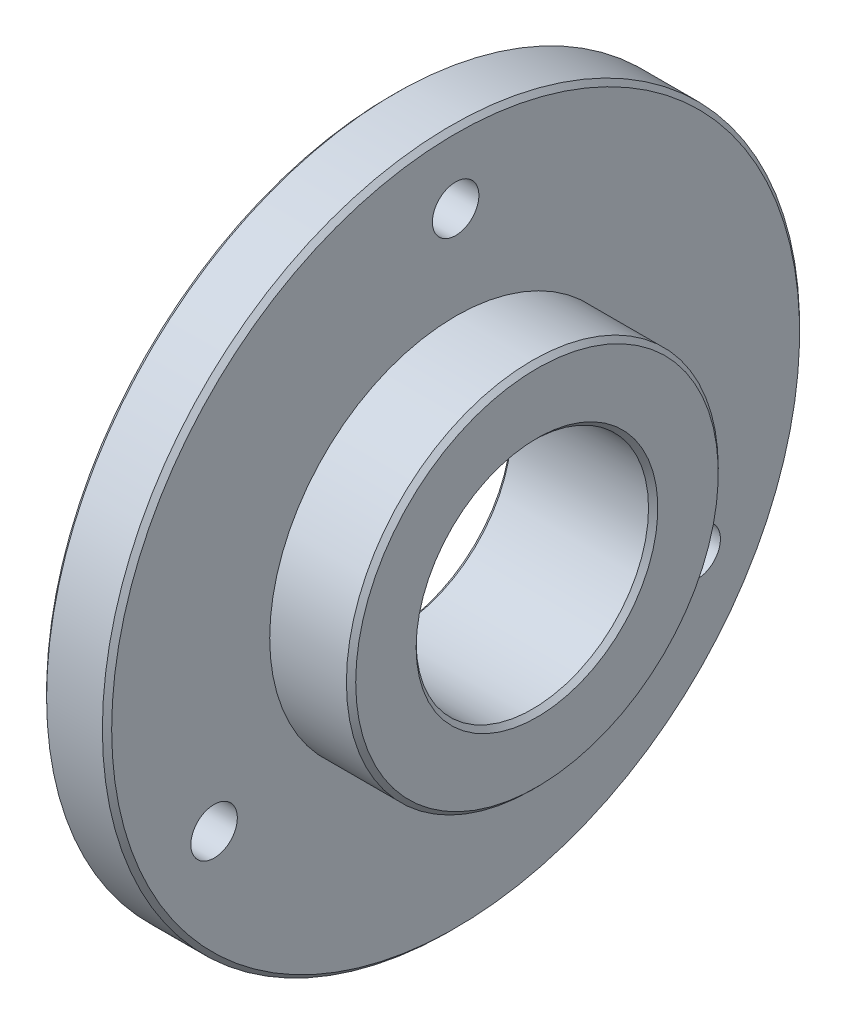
ISO-10303-21;
HEADER;
FILE_DESCRIPTION(('STEP AP214'),'2;1');
FILE_NAME('part.step','',(''),(''),'','','');
FILE_SCHEMA(('AUTOMOTIVE_DESIGN { 1 0 10303 214 1 1 1 1 }'));
ENDSEC;
DATA;
#1=APPLICATION_CONTEXT('core data for automotive mechanical design processes');
#2=APPLICATION_PROTOCOL_DEFINITION('international standard','automotive_design',2000,#1);
#3=PRODUCT_CONTEXT('',#1,'mechanical');
#4=PRODUCT('Part','Part','',(#3));
#5=PRODUCT_RELATED_PRODUCT_CATEGORY('part','',(#4));
#6=PRODUCT_DEFINITION_FORMATION('','',#4);
#7=PRODUCT_DEFINITION_CONTEXT('part definition',#1,'design');
#8=PRODUCT_DEFINITION('design','',#6,#7);
#9=PRODUCT_DEFINITION_SHAPE('','',#8);
#10=(LENGTH_UNIT() NAMED_UNIT(*) SI_UNIT(.MILLI.,.METRE.));
#11=(NAMED_UNIT(*) PLANE_ANGLE_UNIT() SI_UNIT($,.RADIAN.));
#12=(NAMED_UNIT(*) SI_UNIT($,.STERADIAN.) SOLID_ANGLE_UNIT());
#13=UNCERTAINTY_MEASURE_WITH_UNIT(LENGTH_MEASURE(1.E-05),#10,'distance_accuracy_value','');
#14=(GEOMETRIC_REPRESENTATION_CONTEXT(3) GLOBAL_UNCERTAINTY_ASSIGNED_CONTEXT((#13)) GLOBAL_UNIT_ASSIGNED_CONTEXT((#10,
#11,#12)) REPRESENTATION_CONTEXT('',''));
#15=CARTESIAN_POINT('',(0.,0.,0.));
#16=DIRECTION('',(0.,0.,1.));
#17=DIRECTION('',(1.,0.,0.));
#18=AXIS2_PLACEMENT_3D('',#15,#16,#17);
#19=CARTESIAN_POINT('',(-51.2594315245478,0.,0.));
#20=DIRECTION('',(-1.,0.,0.));
#21=DIRECTION('',(0.,0.,1.));
#22=AXIS2_PLACEMENT_3D('',#19,#20,#21);
#23=CYLINDRICAL_SURFACE('',#22,15.);
#24=CARTESIAN_POINT('',(0.199999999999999,0.,0.));
#25=DIRECTION('',(1.,0.,0.));
#26=DIRECTION('',(0.,0.,-1.));
#27=AXIS2_PLACEMENT_3D('',#24,#25,#26);
#28=CIRCLE('',#27,15.);
#29=CARTESIAN_POINT('',(0.199999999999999,0.,-15.));
#30=VERTEX_POINT('',#29);
#31=EDGE_CURVE('E379',#30,#30,#28,.T.);
#32=ORIENTED_EDGE('',*,*,#31,.T.);
#33=EDGE_LOOP('',(#32));
#34=FACE_BOUND('',#33,.T.);
#35=CARTESIAN_POINT('',(2.6,0.,0.));
#36=DIRECTION('',(-1.,0.,0.));
#37=DIRECTION('',(0.,0.,1.));
#38=AXIS2_PLACEMENT_3D('',#35,#36,#37);
#39=CIRCLE('',#38,15.);
#40=CARTESIAN_POINT('',(2.6,0.,15.));
#41=VERTEX_POINT('',#40);
#42=EDGE_CURVE('E382',#41,#41,#39,.T.);
#43=ORIENTED_EDGE('',*,*,#42,.T.);
#44=EDGE_LOOP('',(#43));
#45=FACE_BOUND('',#44,.T.);
#46=ADVANCED_FACE('F360',(#34,#45),#23,.T.);
#47=CARTESIAN_POINT('',(2.8,15.,0.));
#48=DIRECTION('',(-1.,0.,0.));
#49=DIRECTION('',(0.,0.,1.));
#50=AXIS2_PLACEMENT_3D('',#47,#48,#49);
#51=PLANE('',#50);
#52=CARTESIAN_POINT('',(2.8,0.,0.));
#53=DIRECTION('',(-1.,0.,0.));
#54=DIRECTION('',(0.,0.,1.));
#55=AXIS2_PLACEMENT_3D('',#52,#53,#54);
#56=CIRCLE('',#55,14.8);
#57=CARTESIAN_POINT('',(2.8,0.,14.8));
#58=VERTEX_POINT('',#57);
#59=EDGE_CURVE('E374',#58,#58,#56,.F.);
#60=ORIENTED_EDGE('',*,*,#59,.T.);
#61=EDGE_LOOP('',(#60));
#62=FACE_BOUND('',#61,.T.);
#63=CARTESIAN_POINT('',(2.8,-5.9999999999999,10.3923048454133));
#64=DIRECTION('',(1.,0.,0.));
#65=DIRECTION('',(0.,0.866025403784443,0.499999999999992));
#66=AXIS2_PLACEMENT_3D('',#63,#64,#65);
#67=CIRCLE('',#66,1.);
#68=CARTESIAN_POINT('',(2.8,-5.13397459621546,10.8923048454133));
#69=VERTEX_POINT('',#68);
#70=EDGE_CURVE('E415',#69,#69,#67,.T.);
#71=ORIENTED_EDGE('',*,*,#70,.F.);
#72=EDGE_LOOP('',(#71));
#73=FACE_BOUND('',#72,.T.);
#74=CARTESIAN_POINT('',(2.8,-6.00000000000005,-10.3923048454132));
#75=DIRECTION('',(1.,0.,0.));
#76=DIRECTION('',(0.,-0.866025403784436,0.500000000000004));
#77=AXIS2_PLACEMENT_3D('',#74,#75,#76);
#78=CIRCLE('',#77,1.);
#79=CARTESIAN_POINT('',(2.8,-6.86602540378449,-9.89230484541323));
#80=VERTEX_POINT('',#79);
#81=EDGE_CURVE('E409',#80,#80,#78,.T.);
#82=ORIENTED_EDGE('',*,*,#81,.F.);
#83=EDGE_LOOP('',(#82));
#84=FACE_BOUND('',#83,.T.);
#85=CARTESIAN_POINT('',(2.8,12.,0.));
#86=DIRECTION('',(1.,0.,0.));
#87=DIRECTION('',(0.,0.,-1.));
#88=AXIS2_PLACEMENT_3D('',#85,#86,#87);
#89=CIRCLE('',#88,1.);
#90=CARTESIAN_POINT('',(2.8,12.,-1.));
#91=VERTEX_POINT('',#90);
#92=EDGE_CURVE('E403',#91,#91,#89,.T.);
#93=ORIENTED_EDGE('',*,*,#92,.F.);
#94=EDGE_LOOP('',(#93));
#95=FACE_BOUND('',#94,.T.);
#96=CARTESIAN_POINT('',(2.8,0.,0.));
#97=DIRECTION('',(-1.,0.,0.));
#98=DIRECTION('',(0.,0.,1.));
#99=AXIS2_PLACEMENT_3D('',#96,#97,#98);
#100=CIRCLE('',#99,8.);
#101=CARTESIAN_POINT('',(2.8,0.,8.));
#102=VERTEX_POINT('',#101);
#103=EDGE_CURVE('E397',#102,#102,#100,.T.);
#104=ORIENTED_EDGE('',*,*,#103,.T.);
#105=EDGE_LOOP('',(#104));
#106=FACE_BOUND('',#105,.T.);
#107=ADVANCED_FACE('F421',(#62,#73,#84,#95,#106),#51,.F.);
#108=CARTESIAN_POINT('',(-51.2594315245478,0.,0.));
#109=DIRECTION('',(-1.,0.,0.));
#110=DIRECTION('',(0.,0.,1.));
#111=AXIS2_PLACEMENT_3D('',#108,#109,#110);
#112=CYLINDRICAL_SURFACE('',#111,8.);
#113=CARTESIAN_POINT('',(6.10000000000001,0.,0.));
#114=DIRECTION('',(-1.,0.,0.));
#115=DIRECTION('',(0.,0.,1.));
#116=AXIS2_PLACEMENT_3D('',#113,#114,#115);
#117=CIRCLE('',#116,8.);
#118=CARTESIAN_POINT('',(6.10000000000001,0.,8.));
#119=VERTEX_POINT('',#118);
#120=EDGE_CURVE('E370',#119,#119,#117,.T.);
#121=ORIENTED_EDGE('',*,*,#120,.T.);
#122=EDGE_LOOP('',(#121));
#123=FACE_BOUND('',#122,.T.);
#124=ORIENTED_EDGE('',*,*,#103,.F.);
#125=EDGE_LOOP('',(#124));
#126=FACE_BOUND('',#125,.T.);
#127=ADVANCED_FACE('F424',(#123,#126),#112,.T.);
#128=CARTESIAN_POINT('',(6.3,8.,0.));
#129=DIRECTION('',(-1.,0.,0.));
#130=DIRECTION('',(0.,0.,1.));
#131=AXIS2_PLACEMENT_3D('',#128,#129,#130);
#132=PLANE('',#131);
#133=CARTESIAN_POINT('',(6.3,0.,0.));
#134=DIRECTION('',(-1.,0.,0.));
#135=DIRECTION('',(0.,0.,1.));
#136=AXIS2_PLACEMENT_3D('',#133,#134,#135);
#137=CIRCLE('',#136,7.80000000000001);
#138=CARTESIAN_POINT('',(6.3,0.,7.80000000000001));
#139=VERTEX_POINT('',#138);
#140=EDGE_CURVE('E10',#139,#139,#137,.F.);
#141=ORIENTED_EDGE('',*,*,#140,.T.);
#142=EDGE_LOOP('',(#141));
#143=FACE_BOUND('',#142,.T.);
#144=CARTESIAN_POINT('',(6.3,0.,0.));
#145=DIRECTION('',(-1.,0.,0.));
#146=DIRECTION('',(0.,0.,1.));
#147=AXIS2_PLACEMENT_3D('',#144,#145,#146);
#148=CIRCLE('',#147,5.2);
#149=CARTESIAN_POINT('',(6.3,0.,5.2));
#150=VERTEX_POINT('',#149);
#151=EDGE_CURVE('E366',#150,#150,#148,.T.);
#152=ORIENTED_EDGE('',*,*,#151,.T.);
#153=EDGE_LOOP('',(#152));
#154=FACE_BOUND('',#153,.T.);
#155=ADVANCED_FACE('F433',(#143,#154),#132,.F.);
#156=CARTESIAN_POINT('',(-51.2594315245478,0.,0.));
#157=DIRECTION('',(-1.,0.,0.));
#158=DIRECTION('',(0.,0.,1.));
#159=AXIS2_PLACEMENT_3D('',#156,#157,#158);
#160=CYLINDRICAL_SURFACE('',#159,5.);
#161=CARTESIAN_POINT('',(0.199999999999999,0.,0.));
#162=DIRECTION('',(1.,0.,0.));
#163=DIRECTION('',(0.,0.,-1.));
#164=AXIS2_PLACEMENT_3D('',#161,#162,#163);
#165=CIRCLE('',#164,5.);
#166=CARTESIAN_POINT('',(0.199999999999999,0.,-5.));
#167=VERTEX_POINT('',#166);
#168=EDGE_CURVE('E391',#167,#167,#165,.F.);
#169=ORIENTED_EDGE('',*,*,#168,.T.);
#170=EDGE_LOOP('',(#169));
#171=FACE_BOUND('',#170,.T.);
#172=CARTESIAN_POINT('',(6.09999999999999,0.,0.));
#173=DIRECTION('',(-1.,0.,0.));
#174=DIRECTION('',(0.,0.,1.));
#175=AXIS2_PLACEMENT_3D('',#172,#173,#174);
#176=CIRCLE('',#175,5.);
#177=CARTESIAN_POINT('',(6.09999999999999,0.,5.));
#178=VERTEX_POINT('',#177);
#179=EDGE_CURVE('E394',#178,#178,#176,.F.);
#180=ORIENTED_EDGE('',*,*,#179,.T.);
#181=EDGE_LOOP('',(#180));
#182=FACE_BOUND('',#181,.T.);
#183=ADVANCED_FACE('F439',(#171,#182),#160,.F.);
#184=CARTESIAN_POINT('',(0.,5.,0.));
#185=DIRECTION('',(1.,0.,0.));
#186=DIRECTION('',(0.,0.,-1.));
#187=AXIS2_PLACEMENT_3D('',#184,#185,#186);
#188=PLANE('',#187);
#189=CARTESIAN_POINT('',(0.,0.,0.));
#190=DIRECTION('',(1.,0.,0.));
#191=DIRECTION('',(0.,0.,-1.));
#192=AXIS2_PLACEMENT_3D('',#189,#190,#191);
#193=CIRCLE('',#192,5.2);
#194=CARTESIAN_POINT('',(0.,0.,-5.2));
#195=VERTEX_POINT('',#194);
#196=EDGE_CURVE('E385',#195,#195,#193,.T.);
#197=ORIENTED_EDGE('',*,*,#196,.T.);
#198=EDGE_LOOP('',(#197));
#199=FACE_BOUND('',#198,.T.);
#200=CARTESIAN_POINT('',(0.,0.,0.));
#201=DIRECTION('',(1.,0.,0.));
#202=DIRECTION('',(0.,0.,-1.));
#203=AXIS2_PLACEMENT_3D('',#200,#201,#202);
#204=CIRCLE('',#203,14.8);
#205=CARTESIAN_POINT('',(0.,0.,-14.8));
#206=VERTEX_POINT('',#205);
#207=EDGE_CURVE('E388',#206,#206,#204,.F.);
#208=ORIENTED_EDGE('',*,*,#207,.T.);
#209=EDGE_LOOP('',(#208));
#210=FACE_BOUND('',#209,.T.);
#211=CARTESIAN_POINT('',(0.,-5.9999999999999,10.3923048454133));
#212=DIRECTION('',(1.,0.,0.));
#213=DIRECTION('',(0.,0.866025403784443,0.499999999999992));
#214=AXIS2_PLACEMENT_3D('',#211,#212,#213);
#215=CIRCLE('',#214,1.);
#216=CARTESIAN_POINT('',(0.,-5.13397459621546,10.8923048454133));
#217=VERTEX_POINT('',#216);
#218=EDGE_CURVE('E412',#217,#217,#215,.T.);
#219=ORIENTED_EDGE('',*,*,#218,.T.);
#220=EDGE_LOOP('',(#219));
#221=FACE_BOUND('',#220,.T.);
#222=CARTESIAN_POINT('',(0.,-6.00000000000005,-10.3923048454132));
#223=DIRECTION('',(1.,0.,0.));
#224=DIRECTION('',(0.,-0.866025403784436,0.500000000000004));
#225=AXIS2_PLACEMENT_3D('',#222,#223,#224);
#226=CIRCLE('',#225,1.);
#227=CARTESIAN_POINT('',(0.,-6.86602540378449,-9.89230484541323));
#228=VERTEX_POINT('',#227);
#229=EDGE_CURVE('E406',#228,#228,#226,.T.);
#230=ORIENTED_EDGE('',*,*,#229,.T.);
#231=EDGE_LOOP('',(#230));
#232=FACE_BOUND('',#231,.T.);
#233=CARTESIAN_POINT('',(0.,12.,0.));
#234=DIRECTION('',(1.,0.,0.));
#235=DIRECTION('',(0.,0.,-1.));
#236=AXIS2_PLACEMENT_3D('',#233,#234,#235);
#237=CIRCLE('',#236,1.);
#238=CARTESIAN_POINT('',(0.,12.,-1.));
#239=VERTEX_POINT('',#238);
#240=EDGE_CURVE('E400',#239,#239,#237,.T.);
#241=ORIENTED_EDGE('',*,*,#240,.T.);
#242=EDGE_LOOP('',(#241));
#243=FACE_BOUND('',#242,.T.);
#244=ADVANCED_FACE('F482',(#199,#210,#221,#232,#243),#188,.F.);
#245=CARTESIAN_POINT('',(0.,12.,0.));
#246=DIRECTION('',(1.,0.,0.));
#247=DIRECTION('',(0.,0.,-1.));
#248=AXIS2_PLACEMENT_3D('',#245,#246,#247);
#249=CYLINDRICAL_SURFACE('',#248,1.);
#250=ORIENTED_EDGE('',*,*,#240,.F.);
#251=EDGE_LOOP('',(#250));
#252=FACE_BOUND('',#251,.T.);
#253=ORIENTED_EDGE('',*,*,#92,.T.);
#254=EDGE_LOOP('',(#253));
#255=FACE_BOUND('',#254,.T.);
#256=ADVANCED_FACE('F478',(#252,#255),#249,.F.);
#257=CARTESIAN_POINT('',(0.,-6.00000000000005,-10.3923048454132));
#258=DIRECTION('',(1.,0.,0.));
#259=DIRECTION('',(0.,0.,-1.));
#260=AXIS2_PLACEMENT_3D('',#257,#258,#259);
#261=CYLINDRICAL_SURFACE('',#260,1.);
#262=ORIENTED_EDGE('',*,*,#229,.F.);
#263=EDGE_LOOP('',(#262));
#264=FACE_BOUND('',#263,.T.);
#265=ORIENTED_EDGE('',*,*,#81,.T.);
#266=EDGE_LOOP('',(#265));
#267=FACE_BOUND('',#266,.T.);
#268=ADVANCED_FACE('F474',(#264,#267),#261,.F.);
#269=CARTESIAN_POINT('',(0.,-5.9999999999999,10.3923048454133));
#270=DIRECTION('',(1.,0.,0.));
#271=DIRECTION('',(0.,0.,-1.));
#272=AXIS2_PLACEMENT_3D('',#269,#270,#271);
#273=CYLINDRICAL_SURFACE('',#272,1.);
#274=ORIENTED_EDGE('',*,*,#218,.F.);
#275=EDGE_LOOP('',(#274));
#276=FACE_BOUND('',#275,.T.);
#277=ORIENTED_EDGE('',*,*,#70,.T.);
#278=EDGE_LOOP('',(#277));
#279=FACE_BOUND('',#278,.T.);
#280=ADVANCED_FACE('F419',(#276,#279),#273,.F.);
#281=CARTESIAN_POINT('',(0.199999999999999,0.,0.));
#282=DIRECTION('',(-1.,0.,0.));
#283=DIRECTION('',(0.,0.,1.));
#284=AXIS2_PLACEMENT_3D('',#281,#282,#283);
#285=CONICAL_SURFACE('',#284,5.,0.785398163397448);
#286=ORIENTED_EDGE('',*,*,#196,.F.);
#287=EDGE_LOOP('',(#286));
#288=FACE_BOUND('',#287,.T.);
#289=ORIENTED_EDGE('',*,*,#168,.F.);
#290=EDGE_LOOP('',(#289));
#291=FACE_BOUND('',#290,.T.);
#292=ADVANCED_FACE('F463',(#288,#291),#285,.F.);
#293=CARTESIAN_POINT('',(0.,0.,0.));
#294=DIRECTION('',(1.,0.,0.));
#295=DIRECTION('',(0.,0.,-1.));
#296=AXIS2_PLACEMENT_3D('',#293,#294,#295);
#297=CONICAL_SURFACE('',#296,14.8,0.785398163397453);
#298=ORIENTED_EDGE('',*,*,#31,.F.);
#299=EDGE_LOOP('',(#298));
#300=FACE_BOUND('',#299,.T.);
#301=ORIENTED_EDGE('',*,*,#207,.F.);
#302=EDGE_LOOP('',(#301));
#303=FACE_BOUND('',#302,.T.);
#304=ADVANCED_FACE('F453',(#300,#303),#297,.T.);
#305=CARTESIAN_POINT('',(2.6,0.,0.));
#306=DIRECTION('',(-1.,0.,0.));
#307=DIRECTION('',(0.,0.,1.));
#308=AXIS2_PLACEMENT_3D('',#305,#306,#307);
#309=CONICAL_SURFACE('',#308,15.,0.78539816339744);
#310=ORIENTED_EDGE('',*,*,#59,.F.);
#311=EDGE_LOOP('',(#310));
#312=FACE_BOUND('',#311,.T.);
#313=ORIENTED_EDGE('',*,*,#42,.F.);
#314=EDGE_LOOP('',(#313));
#315=FACE_BOUND('',#314,.T.);
#316=ADVANCED_FACE('F450',(#312,#315),#309,.T.);
#317=CARTESIAN_POINT('',(6.10000000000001,0.,0.));
#318=DIRECTION('',(-1.,0.,0.));
#319=DIRECTION('',(0.,0.,1.));
#320=AXIS2_PLACEMENT_3D('',#317,#318,#319);
#321=CONICAL_SURFACE('',#320,8.,0.785398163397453);
#322=ORIENTED_EDGE('',*,*,#140,.F.);
#323=EDGE_LOOP('',(#322));
#324=FACE_BOUND('',#323,.T.);
#325=ORIENTED_EDGE('',*,*,#120,.F.);
#326=EDGE_LOOP('',(#325));
#327=FACE_BOUND('',#326,.T.);
#328=ADVANCED_FACE('F452',(#324,#327),#321,.T.);
#329=CARTESIAN_POINT('',(6.3,0.,0.));
#330=DIRECTION('',(1.,0.,0.));
#331=DIRECTION('',(0.,0.,-1.));
#332=AXIS2_PLACEMENT_3D('',#329,#330,#331);
#333=CONICAL_SURFACE('',#332,5.2,0.785398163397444);
#334=ORIENTED_EDGE('',*,*,#179,.F.);
#335=EDGE_LOOP('',(#334));
#336=FACE_BOUND('',#335,.T.);
#337=ORIENTED_EDGE('',*,*,#151,.F.);
#338=EDGE_LOOP('',(#337));
#339=FACE_BOUND('',#338,.T.);
#340=ADVANCED_FACE('F460',(#336,#339),#333,.F.);
#341=CLOSED_SHELL('',(#46,#107,#127,#155,#183,#244,#256,#268,#280,#292,#304,#316,#328,#340));
#342=MANIFOLD_SOLID_BREP('B2',#341);
#343=ADVANCED_BREP_SHAPE_REPRESENTATION('',(#18,#342),#14);
#344=SHAPE_DEFINITION_REPRESENTATION(#9,#343);
ENDSEC;
END-ISO-10303-21;
